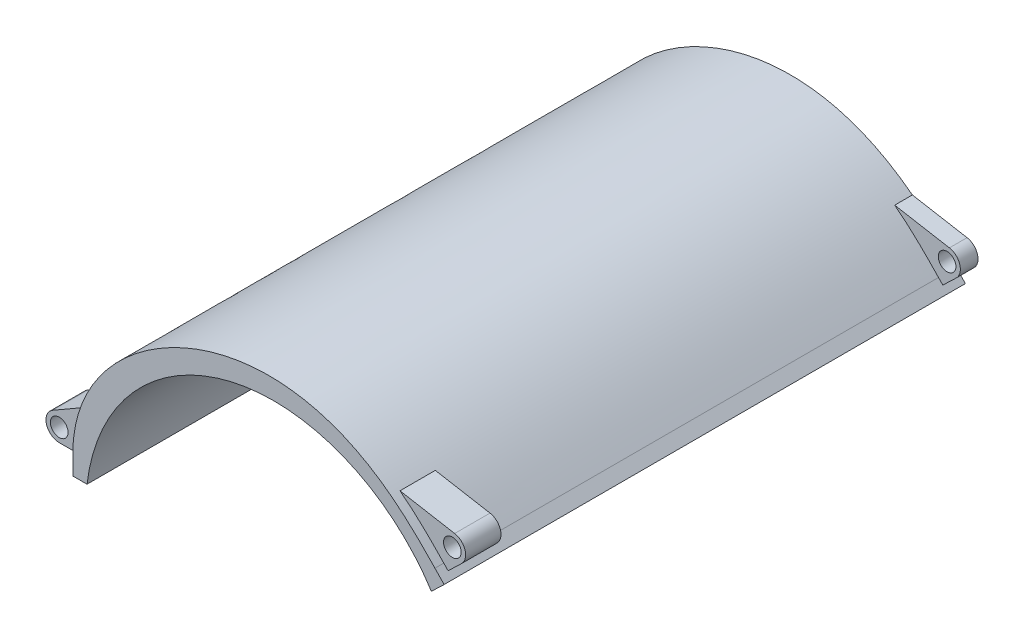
ISO-10303-21;
HEADER;
FILE_DESCRIPTION(('STEP AP214'),'2;1');
FILE_NAME('part.step','',(''),(''),'','','');
FILE_SCHEMA(('AUTOMOTIVE_DESIGN { 1 0 10303 214 1 1 1 1 }'));
ENDSEC;
DATA;
#1=APPLICATION_CONTEXT('core data for automotive mechanical design processes');
#2=APPLICATION_PROTOCOL_DEFINITION('international standard','automotive_design',2000,#1);
#3=PRODUCT_CONTEXT('',#1,'mechanical');
#4=PRODUCT('Part','Part','',(#3));
#5=PRODUCT_RELATED_PRODUCT_CATEGORY('part','',(#4));
#6=PRODUCT_DEFINITION_FORMATION('','',#4);
#7=PRODUCT_DEFINITION_CONTEXT('part definition',#1,'design');
#8=PRODUCT_DEFINITION('design','',#6,#7);
#9=PRODUCT_DEFINITION_SHAPE('','',#8);
#10=(LENGTH_UNIT() NAMED_UNIT(*) SI_UNIT(.MILLI.,.METRE.));
#11=(NAMED_UNIT(*) PLANE_ANGLE_UNIT() SI_UNIT($,.RADIAN.));
#12=(NAMED_UNIT(*) SI_UNIT($,.STERADIAN.) SOLID_ANGLE_UNIT());
#13=UNCERTAINTY_MEASURE_WITH_UNIT(LENGTH_MEASURE(1.E-05),#10,'distance_accuracy_value','');
#14=(GEOMETRIC_REPRESENTATION_CONTEXT(3) GLOBAL_UNCERTAINTY_ASSIGNED_CONTEXT((#13)) GLOBAL_UNIT_ASSIGNED_CONTEXT((#10,
#11,#12)) REPRESENTATION_CONTEXT('',''));
#15=CARTESIAN_POINT('',(0.,0.,0.));
#16=DIRECTION('',(0.,0.,1.));
#17=DIRECTION('',(1.,0.,0.));
#18=AXIS2_PLACEMENT_3D('',#15,#16,#17);
#19=CARTESIAN_POINT('',(-69.7200278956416,139.572690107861,295.));
#20=CARTESIAN_POINT('',(-108.187547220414,179.583185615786,295.));
#21=CARTESIAN_POINT('',(-152.416815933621,225.58654086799,295.));
#22=CARTESIAN_POINT('',(-219.133886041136,251.435560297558,295.));
#23=CARTESIAN_POINT('',(-287.408844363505,253.328836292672,295.));
#24=CARTESIAN_POINT('',(-359.356081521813,236.563554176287,295.));
#25=CARTESIAN_POINT('',(-477.15378099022,170.567422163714,295.));
#26=CARTESIAN_POINT('',(-479.524287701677,50.,295.));
#27=B_SPLINE_CURVE_WITH_KNOTS('',7,(#19,#20,#21,#22,#23,#24,#25,#26),.UNSPECIFIED.,.F.,.F.,(8,
8),(0.,1.),.UNSPECIFIED.);
#28=DIRECTION('',(0.,0.,-1.));
#29=VECTOR('',#28,1.);
#30=SURFACE_OF_LINEAR_EXTRUSION('',#27,#29);
#31=CARTESIAN_POINT('',(-119.307330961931,185.688881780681,-275.));
#32=CARTESIAN_POINT('',(-111.333957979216,179.561593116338,-275.));
#33=CARTESIAN_POINT('',(-103.683856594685,173.1559041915,-275.));
#34=CARTESIAN_POINT('',(-96.3532676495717,166.535005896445,-275.));
#35=CARTESIAN_POINT('',(-89.3294022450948,159.772367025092,-275.));
#36=CARTESIAN_POINT('',(-82.5854794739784,152.954189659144,-275.));
#37=CARTESIAN_POINT('',(-76.0741492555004,146.181682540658,-275.));
#38=CARTESIAN_POINT('',(-69.7200278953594,139.572690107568,-275.));
#39=B_SPLINE_CURVE_WITH_KNOTS('',7,(#31,#32,#33,#34,#35,#36,#37,#38),.UNSPECIFIED.,.F.,.F.,(8,
8),(0.,1.),.UNSPECIFIED.);
#40=CARTESIAN_POINT('',(-119.307330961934,185.688881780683,-275.));
#41=VERTEX_POINT('',#40);
#42=CARTESIAN_POINT('',(-69.7200278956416,139.572690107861,-275.));
#43=VERTEX_POINT('',#42);
#44=EDGE_CURVE('E58',#41,#43,#39,.T.);
#45=ORIENTED_EDGE('',*,*,#44,.F.);
#46=CARTESIAN_POINT('',(-119.307330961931,185.688881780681,-275.));
#47=DIRECTION('',(0.,0.,-1.));
#48=VECTOR('',#47,1.);
#49=LINE('',#46,#48);
#50=CARTESIAN_POINT('',(-119.307330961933,185.688881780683,-295.));
#51=VERTEX_POINT('',#50);
#52=EDGE_CURVE('E217',#41,#51,#49,.T.);
#53=ORIENTED_EDGE('',*,*,#52,.T.);
#54=CARTESIAN_POINT('',(-69.7200278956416,139.572690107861,-295.));
#55=CARTESIAN_POINT('',(-108.187547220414,179.583185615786,-295.));
#56=CARTESIAN_POINT('',(-152.416815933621,225.58654086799,-295.));
#57=CARTESIAN_POINT('',(-219.133886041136,251.435560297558,-295.));
#58=CARTESIAN_POINT('',(-287.408844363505,253.328836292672,-295.));
#59=CARTESIAN_POINT('',(-359.356081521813,236.563554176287,-295.));
#60=CARTESIAN_POINT('',(-477.15378099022,170.567422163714,-295.));
#61=CARTESIAN_POINT('',(-479.524287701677,50.,-295.));
#62=B_SPLINE_CURVE_WITH_KNOTS('',7,(#54,#55,#56,#57,#58,#59,#60,#61),.UNSPECIFIED.,.F.,.F.,(8,
8),(0.,1.),.UNSPECIFIED.);
#63=CARTESIAN_POINT('',(-472.826933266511,90.8956367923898,-295.));
#64=VERTEX_POINT('',#63);
#65=EDGE_CURVE('E370',#51,#64,#62,.T.);
#66=ORIENTED_EDGE('',*,*,#65,.T.);
#67=DIRECTION('',(0.,0.,-1.));
#68=VECTOR('',#67,1.);
#69=CARTESIAN_POINT('',(-472.826933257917,90.8956368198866,-275.));
#70=LINE('',#69,#68);
#71=CARTESIAN_POINT('',(-472.82693326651,90.8956367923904,-275.));
#72=VERTEX_POINT('',#71);
#73=EDGE_CURVE('E397',#72,#64,#70,.T.);
#74=ORIENTED_EDGE('',*,*,#73,.F.);
#75=CARTESIAN_POINT('',(-479.524287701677,50.0000000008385,-275.));
#76=CARTESIAN_POINT('',(-479.40077470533,56.2820507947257,-275.));
#77=CARTESIAN_POINT('',(-478.963896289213,62.4159497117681,-275.));
#78=CARTESIAN_POINT('',(-478.236465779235,68.4024521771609,-275.));
#79=CARTESIAN_POINT('',(-477.239796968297,74.2424995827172,-275.));
#80=CARTESIAN_POINT('',(-475.993797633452,79.9371958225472,-275.));
#81=CARTESIAN_POINT('',(-474.517057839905,85.4877859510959,-275.));
#82=CARTESIAN_POINT('',(-472.826933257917,90.8956368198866,-275.));
#83=B_SPLINE_CURVE_WITH_KNOTS('',7,(#75,#76,#77,#78,#79,#80,#81,#82),.UNSPECIFIED.,.F.,.F.,(8,
8),(0.,1.),.UNSPECIFIED.);
#84=CARTESIAN_POINT('',(-479.524287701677,50.,-275.));
#85=VERTEX_POINT('',#84);
#86=EDGE_CURVE('E411',#85,#72,#83,.T.);
#87=ORIENTED_EDGE('',*,*,#86,.F.);
#88=DIRECTION('',(0.,0.,-1.));
#89=VECTOR('',#88,1.);
#90=CARTESIAN_POINT('',(-479.524287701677,50.,295.));
#91=LINE('',#90,#89);
#92=CARTESIAN_POINT('',(-479.524287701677,50.0000000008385,245.));
#93=VERTEX_POINT('',#92);
#94=EDGE_CURVE('E393',#93,#85,#91,.T.);
#95=ORIENTED_EDGE('',*,*,#94,.F.);
#96=CARTESIAN_POINT('',(-479.524287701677,50.0000000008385,245.));
#97=CARTESIAN_POINT('',(-479.40077470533,56.2820507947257,245.));
#98=CARTESIAN_POINT('',(-478.963896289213,62.4159497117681,245.));
#99=CARTESIAN_POINT('',(-478.236465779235,68.4024521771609,245.));
#100=CARTESIAN_POINT('',(-477.239796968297,74.2424995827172,245.));
#101=CARTESIAN_POINT('',(-475.993797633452,79.9371958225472,245.));
#102=CARTESIAN_POINT('',(-474.517057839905,85.4877859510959,245.));
#103=CARTESIAN_POINT('',(-472.826933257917,90.8956368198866,245.));
#104=B_SPLINE_CURVE_WITH_KNOTS('',7,(#96,#97,#98,#99,#100,#101,#102,#103),.UNSPECIFIED.,.F.,.F.,
(8,8),(0.94789595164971,1.),.UNSPECIFIED.);
#105=CARTESIAN_POINT('',(-472.826933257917,90.8956368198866,245.));
#106=VERTEX_POINT('',#105);
#107=EDGE_CURVE('E513',#93,#106,#104,.T.);
#108=ORIENTED_EDGE('',*,*,#107,.T.);
#109=DIRECTION('',(0.,0.,1.));
#110=VECTOR('',#109,1.);
#111=CARTESIAN_POINT('',(-472.826933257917,90.8956368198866,245.));
#112=LINE('',#111,#110);
#113=CARTESIAN_POINT('',(-472.826933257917,90.8956368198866,285.));
#114=VERTEX_POINT('',#113);
#115=EDGE_CURVE('E541',#106,#114,#112,.T.);
#116=ORIENTED_EDGE('',*,*,#115,.T.);
#117=CARTESIAN_POINT('',(-479.524287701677,50.0000000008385,285.));
#118=CARTESIAN_POINT('',(-479.40077470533,56.2820507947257,285.));
#119=CARTESIAN_POINT('',(-478.963896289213,62.4159497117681,285.));
#120=CARTESIAN_POINT('',(-478.236465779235,68.4024521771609,285.));
#121=CARTESIAN_POINT('',(-477.239796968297,74.2424995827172,285.));
#122=CARTESIAN_POINT('',(-475.993797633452,79.9371958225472,285.));
#123=CARTESIAN_POINT('',(-474.517057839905,85.4877859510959,285.));
#124=CARTESIAN_POINT('',(-472.826933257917,90.8956368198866,285.));
#125=B_SPLINE_CURVE_WITH_KNOTS('',7,(#117,#118,#119,#120,#121,#122,#123,#124),.UNSPECIFIED.,.F.,
.F.,(8,8),(0.94789595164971,1.),.UNSPECIFIED.);
#126=CARTESIAN_POINT('',(-479.524287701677,50.0000000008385,285.));
#127=VERTEX_POINT('',#126);
#128=EDGE_CURVE('E531',#127,#114,#125,.T.);
#129=ORIENTED_EDGE('',*,*,#128,.F.);
#130=CARTESIAN_POINT('',(-479.524287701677,50.,295.));
#131=VERTEX_POINT('',#130);
#132=EDGE_CURVE('E387',#131,#127,#91,.T.);
#133=ORIENTED_EDGE('',*,*,#132,.F.);
#134=CARTESIAN_POINT('',(-69.7200278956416,139.572690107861,295.));
#135=VERTEX_POINT('',#134);
#136=EDGE_CURVE('E348',#135,#131,#27,.T.);
#137=ORIENTED_EDGE('',*,*,#136,.F.);
#138=DIRECTION('',(0.,0.,-1.));
#139=VECTOR('',#138,1.);
#140=CARTESIAN_POINT('',(-69.7200278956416,139.572690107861,295.));
#141=LINE('',#140,#139);
#142=CARTESIAN_POINT('',(-69.7200278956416,139.572690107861,285.));
#143=VERTEX_POINT('',#142);
#144=EDGE_CURVE('E11',#135,#143,#141,.T.);
#145=ORIENTED_EDGE('',*,*,#144,.T.);
#146=CARTESIAN_POINT('',(-119.307330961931,185.688881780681,285.));
#147=CARTESIAN_POINT('',(-111.333957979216,179.561593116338,285.));
#148=CARTESIAN_POINT('',(-103.683856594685,173.1559041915,285.));
#149=CARTESIAN_POINT('',(-96.3532676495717,166.535005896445,285.));
#150=CARTESIAN_POINT('',(-89.3294022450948,159.772367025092,285.));
#151=CARTESIAN_POINT('',(-82.5854794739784,152.954189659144,285.));
#152=CARTESIAN_POINT('',(-76.0741492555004,146.181682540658,285.));
#153=CARTESIAN_POINT('',(-69.7200278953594,139.572690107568,285.));
#154=B_SPLINE_CURVE_WITH_KNOTS('',7,(#146,#147,#148,#149,#150,#151,#152,#153),.UNSPECIFIED.,.F.,
.F.,(8,8),(0.,0.165181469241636),.UNSPECIFIED.);
#155=CARTESIAN_POINT('',(-119.307330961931,185.688881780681,285.));
#156=VERTEX_POINT('',#155);
#157=EDGE_CURVE('E466',#156,#143,#154,.T.);
#158=ORIENTED_EDGE('',*,*,#157,.F.);
#159=DIRECTION('',(0.,0.,1.));
#160=VECTOR('',#159,1.);
#161=CARTESIAN_POINT('',(-119.307330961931,185.688881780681,245.));
#162=LINE('',#161,#160);
#163=CARTESIAN_POINT('',(-119.307330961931,185.688881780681,245.));
#164=VERTEX_POINT('',#163);
#165=EDGE_CURVE('E400',#164,#156,#162,.T.);
#166=ORIENTED_EDGE('',*,*,#165,.F.);
#167=CARTESIAN_POINT('',(-119.307330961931,185.688881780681,245.));
#168=CARTESIAN_POINT('',(-111.333957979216,179.561593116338,245.));
#169=CARTESIAN_POINT('',(-103.683856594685,173.1559041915,245.));
#170=CARTESIAN_POINT('',(-96.3532676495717,166.535005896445,245.));
#171=CARTESIAN_POINT('',(-89.3294022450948,159.772367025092,245.));
#172=CARTESIAN_POINT('',(-82.5854794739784,152.954189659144,245.));
#173=CARTESIAN_POINT('',(-76.0741492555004,146.181682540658,245.));
#174=CARTESIAN_POINT('',(-69.7200278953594,139.572690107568,245.));
#175=B_SPLINE_CURVE_WITH_KNOTS('',7,(#167,#168,#169,#170,#171,#172,#173,#174),.UNSPECIFIED.,.F.,
.F.,(8,8),(0.,0.165181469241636),.UNSPECIFIED.);
#176=CARTESIAN_POINT('',(-69.7200278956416,139.572690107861,245.));
#177=VERTEX_POINT('',#176);
#178=EDGE_CURVE('E457',#164,#177,#175,.T.);
#179=ORIENTED_EDGE('',*,*,#178,.T.);
#180=EDGE_CURVE('E50',#177,#43,#141,.T.);
#181=ORIENTED_EDGE('',*,*,#180,.T.);
#182=EDGE_LOOP('',(#45,#53,#66,#74,#87,#95,#108,#116,#129,#133,#137,#145,#158,#166,#179,#181));
#183=FACE_BOUND('',#182,.T.);
#184=ADVANCED_FACE('F41',(#183),#30,.F.);
#185=CARTESIAN_POINT('',(-479.524287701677,25.,295.));
#186=DIRECTION('',(1.,0.,0.));
#187=DIRECTION('',(0.,1.,0.));
#188=AXIS2_PLACEMENT_3D('',#185,#186,#187);
#189=PLANE('',#188);
#190=DIRECTION('',(0.,-1.,0.));
#191=VECTOR('',#190,1.);
#192=CARTESIAN_POINT('',(-479.524287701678,234.472912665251,-275.));
#193=LINE('',#192,#191);
#194=CARTESIAN_POINT('',(-479.524287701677,40.,-275.));
#195=VERTEX_POINT('',#194);
#196=EDGE_CURVE('E419',#85,#195,#193,.T.);
#197=ORIENTED_EDGE('',*,*,#196,.T.);
#198=DIRECTION('',(0.,0.,-1.));
#199=VECTOR('',#198,1.);
#200=CARTESIAN_POINT('',(-479.524287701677,40.,-275.));
#201=LINE('',#200,#199);
#202=CARTESIAN_POINT('',(-479.524287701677,40.,-295.));
#203=VERTEX_POINT('',#202);
#204=EDGE_CURVE('E423',#195,#203,#201,.T.);
#205=ORIENTED_EDGE('',*,*,#204,.T.);
#206=DIRECTION('',(0.,-1.,0.));
#207=VECTOR('',#206,1.);
#208=CARTESIAN_POINT('',(-479.524287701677,25.,-295.));
#209=LINE('',#208,#207);
#210=CARTESIAN_POINT('',(-479.524287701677,25.,-295.));
#211=VERTEX_POINT('',#210);
#212=EDGE_CURVE('E376',#203,#211,#209,.T.);
#213=ORIENTED_EDGE('',*,*,#212,.T.);
#214=DIRECTION('',(0.,0.,-1.));
#215=VECTOR('',#214,1.);
#216=CARTESIAN_POINT('',(-479.524287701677,25.,295.));
#217=LINE('',#216,#215);
#218=CARTESIAN_POINT('',(-479.524287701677,25.,295.));
#219=VERTEX_POINT('',#218);
#220=EDGE_CURVE('E396',#219,#211,#217,.T.);
#221=ORIENTED_EDGE('',*,*,#220,.F.);
#222=DIRECTION('',(0.,-1.,0.));
#223=VECTOR('',#222,1.);
#224=CARTESIAN_POINT('',(-479.524287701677,25.,295.));
#225=LINE('',#224,#223);
#226=EDGE_CURVE('E354',#131,#219,#225,.T.);
#227=ORIENTED_EDGE('',*,*,#226,.F.);
#228=ORIENTED_EDGE('',*,*,#132,.T.);
#229=DIRECTION('',(0.,1.,0.));
#230=VECTOR('',#229,1.);
#231=CARTESIAN_POINT('',(-479.524287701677,50.0000000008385,285.));
#232=LINE('',#231,#230);
#233=CARTESIAN_POINT('',(-479.524287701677,40.,285.));
#234=VERTEX_POINT('',#233);
#235=EDGE_CURVE('E529',#234,#127,#232,.T.);
#236=ORIENTED_EDGE('',*,*,#235,.F.);
#237=DIRECTION('',(0.,0.,1.));
#238=VECTOR('',#237,1.);
#239=CARTESIAN_POINT('',(-479.524287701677,40.,245.));
#240=LINE('',#239,#238);
#241=CARTESIAN_POINT('',(-479.524287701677,40.,245.));
#242=VERTEX_POINT('',#241);
#243=EDGE_CURVE('E544',#242,#234,#240,.T.);
#244=ORIENTED_EDGE('',*,*,#243,.F.);
#245=DIRECTION('',(0.,1.,0.));
#246=VECTOR('',#245,1.);
#247=CARTESIAN_POINT('',(-479.524287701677,50.0000000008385,245.));
#248=LINE('',#247,#246);
#249=EDGE_CURVE('E510',#242,#93,#248,.T.);
#250=ORIENTED_EDGE('',*,*,#249,.T.);
#251=ORIENTED_EDGE('',*,*,#94,.T.);
#252=EDGE_LOOP('',(#197,#205,#213,#221,#227,#228,#236,#244,#250,#251));
#253=FACE_BOUND('',#252,.T.);
#254=ADVANCED_FACE('F341',(#253),#189,.F.);
#255=CARTESIAN_POINT('',(-59.3239744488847,128.759639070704,295.));
#256=DIRECTION('',(-0.720870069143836,-0.693070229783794,0.));
#257=DIRECTION('',(0.693070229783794,-0.720870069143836,0.));
#258=AXIS2_PLACEMENT_3D('',#255,#256,#257);
#259=PLANE('',#258);
#260=DIRECTION('',(-0.693070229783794,0.720870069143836,0.));
#261=VECTOR('',#260,1.);
#262=CARTESIAN_POINT('',(-59.3239744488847,128.759639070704,-295.));
#263=LINE('',#262,#261);
#264=CARTESIAN_POINT('',(-59.3239744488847,128.759639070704,-295.));
#265=VERTEX_POINT('',#264);
#266=CARTESIAN_POINT('',(-64.8607561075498,134.51850737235,-295.));
#267=VERTEX_POINT('',#266);
#268=EDGE_CURVE('E368',#265,#267,#263,.T.);
#269=ORIENTED_EDGE('',*,*,#268,.T.);
#270=DIRECTION('',(0.,0.,-1.));
#271=VECTOR('',#270,1.);
#272=CARTESIAN_POINT('',(-64.8607561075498,134.51850737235,-275.));
#273=LINE('',#272,#271);
#274=CARTESIAN_POINT('',(-64.8607561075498,134.51850737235,-275.));
#275=VERTEX_POINT('',#274);
#276=EDGE_CURVE('E66',#275,#267,#273,.T.);
#277=ORIENTED_EDGE('',*,*,#276,.F.);
#278=DIRECTION('',(-0.693070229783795,0.720870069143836,0.));
#279=VECTOR('',#278,1.);
#280=CARTESIAN_POINT('',(-207.944056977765,283.341043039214,-275.));
#281=LINE('',#280,#279);
#282=EDGE_CURVE('E229',#275,#43,#281,.T.);
#283=ORIENTED_EDGE('',*,*,#282,.T.);
#284=ORIENTED_EDGE('',*,*,#180,.F.);
#285=DIRECTION('',(0.693070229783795,-0.720870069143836,0.));
#286=VECTOR('',#285,1.);
#287=CARTESIAN_POINT('',(-64.8607561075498,134.51850737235,245.));
#288=LINE('',#287,#286);
#289=CARTESIAN_POINT('',(-64.8607561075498,134.51850737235,245.));
#290=VERTEX_POINT('',#289);
#291=EDGE_CURVE('E483',#177,#290,#288,.T.);
#292=ORIENTED_EDGE('',*,*,#291,.T.);
#293=DIRECTION('',(0.,0.,1.));
#294=VECTOR('',#293,1.);
#295=CARTESIAN_POINT('',(-64.8607561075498,134.51850737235,245.));
#296=LINE('',#295,#294);
#297=CARTESIAN_POINT('',(-64.8607561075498,134.51850737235,285.));
#298=VERTEX_POINT('',#297);
#299=EDGE_CURVE('E444',#290,#298,#296,.T.);
#300=ORIENTED_EDGE('',*,*,#299,.T.);
#301=DIRECTION('',(0.693070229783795,-0.720870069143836,0.));
#302=VECTOR('',#301,1.);
#303=CARTESIAN_POINT('',(-64.8607561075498,134.51850737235,285.));
#304=LINE('',#303,#302);
#305=EDGE_CURVE('E463',#143,#298,#304,.T.);
#306=ORIENTED_EDGE('',*,*,#305,.F.);
#307=ORIENTED_EDGE('',*,*,#144,.F.);
#308=DIRECTION('',(-0.693070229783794,0.720870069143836,0.));
#309=VECTOR('',#308,1.);
#310=CARTESIAN_POINT('',(-59.3239744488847,128.759639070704,295.));
#311=LINE('',#310,#309);
#312=CARTESIAN_POINT('',(-59.3239744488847,128.759639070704,295.));
#313=VERTEX_POINT('',#312);
#314=EDGE_CURVE('E355',#313,#135,#311,.T.);
#315=ORIENTED_EDGE('',*,*,#314,.F.);
#316=DIRECTION('',(0.,0.,-1.));
#317=VECTOR('',#316,1.);
#318=CARTESIAN_POINT('',(-59.3239744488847,128.759639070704,295.));
#319=LINE('',#318,#317);
#320=EDGE_CURVE('E367',#313,#265,#319,.T.);
#321=ORIENTED_EDGE('',*,*,#320,.T.);
#322=EDGE_LOOP('',(#269,#277,#283,#284,#292,#300,#306,#307,#315,#321));
#323=FACE_BOUND('',#322,.T.);
#324=ADVANCED_FACE('F43',(#323),#259,.F.);
#325=CARTESIAN_POINT('',(-463.524287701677,25.,295.));
#326=DIRECTION('',(0.,1.,0.));
#327=DIRECTION('',(0.,0.,1.));
#328=AXIS2_PLACEMENT_3D('',#325,#326,#327);
#329=PLANE('',#328);
#330=DIRECTION('',(1.,0.,0.));
#331=VECTOR('',#330,1.);
#332=CARTESIAN_POINT('',(-463.524287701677,25.,-295.));
#333=LINE('',#332,#331);
#334=CARTESIAN_POINT('',(-463.524287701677,25.0000000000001,-295.));
#335=VERTEX_POINT('',#334);
#336=EDGE_CURVE('E615',#211,#335,#333,.T.);
#337=ORIENTED_EDGE('',*,*,#336,.T.);
#338=DIRECTION('',(0.,0.,-1.));
#339=VECTOR('',#338,1.);
#340=CARTESIAN_POINT('',(-463.524287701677,25.0000000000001,295.));
#341=LINE('',#340,#339);
#342=CARTESIAN_POINT('',(-463.524287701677,25.0000000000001,295.));
#343=VERTEX_POINT('',#342);
#344=EDGE_CURVE('E627',#343,#335,#341,.T.);
#345=ORIENTED_EDGE('',*,*,#344,.F.);
#346=DIRECTION('',(1.,0.,0.));
#347=VECTOR('',#346,1.);
#348=CARTESIAN_POINT('',(-463.524287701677,25.,295.));
#349=LINE('',#348,#347);
#350=EDGE_CURVE('E361',#219,#343,#349,.T.);
#351=ORIENTED_EDGE('',*,*,#350,.F.);
#352=ORIENTED_EDGE('',*,*,#220,.T.);
#353=EDGE_LOOP('',(#337,#345,#351,#352));
#354=FACE_BOUND('',#353,.T.);
#355=ADVANCED_FACE('F336',(#354),#329,.F.);
#356=CARTESIAN_POINT('',(-252.5,1.52655665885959E-13,295.));
#357=DIRECTION('',(0.,0.,-1.));
#358=DIRECTION('',(-1.,0.,0.));
#359=AXIS2_PLACEMENT_3D('',#356,#357,#358);
#360=CYLINDRICAL_SURFACE('',#359,212.5);
#361=CARTESIAN_POINT('',(-252.5,1.52655665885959E-13,-295.));
#362=DIRECTION('',(0.,0.,-1.));
#363=DIRECTION('',(1.,0.,0.));
#364=AXIS2_PLACEMENT_3D('',#361,#362,#363);
#365=CIRCLE('',#364,212.5);
#366=CARTESIAN_POINT('',(-73.7413758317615,114.898234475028,-295.));
#367=VERTEX_POINT('',#366);
#368=EDGE_CURVE('E617',#335,#367,#365,.T.);
#369=ORIENTED_EDGE('',*,*,#368,.T.);
#370=DIRECTION('',(0.,0.,-1.));
#371=VECTOR('',#370,1.);
#372=CARTESIAN_POINT('',(-73.7413758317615,114.898234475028,295.));
#373=LINE('',#372,#371);
#374=CARTESIAN_POINT('',(-73.7413758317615,114.898234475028,295.));
#375=VERTEX_POINT('',#374);
#376=EDGE_CURVE('E624',#375,#367,#373,.T.);
#377=ORIENTED_EDGE('',*,*,#376,.F.);
#378=CARTESIAN_POINT('',(-252.5,1.52655665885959E-13,295.));
#379=DIRECTION('',(0.,0.,-1.));
#380=DIRECTION('',(1.,0.,0.));
#381=AXIS2_PLACEMENT_3D('',#378,#379,#380);
#382=CIRCLE('',#381,212.5);
#383=EDGE_CURVE('E363',#343,#375,#382,.T.);
#384=ORIENTED_EDGE('',*,*,#383,.F.);
#385=ORIENTED_EDGE('',*,*,#344,.T.);
#386=EDGE_LOOP('',(#369,#377,#384,#385));
#387=FACE_BOUND('',#386,.T.);
#388=ADVANCED_FACE('F332',(#387),#360,.F.);
#389=CARTESIAN_POINT('',(-59.3239744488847,128.759639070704,295.));
#390=DIRECTION('',(-0.693070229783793,0.720870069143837,0.));
#391=DIRECTION('',(-0.720870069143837,-0.693070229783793,0.));
#392=AXIS2_PLACEMENT_3D('',#389,#390,#391);
#393=PLANE('',#392);
#394=DIRECTION('',(0.720870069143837,0.693070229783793,0.));
#395=VECTOR('',#394,1.);
#396=CARTESIAN_POINT('',(-59.3239744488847,128.759639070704,-295.));
#397=LINE('',#396,#395);
#398=EDGE_CURVE('E568',#367,#265,#397,.T.);
#399=ORIENTED_EDGE('',*,*,#398,.T.);
#400=ORIENTED_EDGE('',*,*,#320,.F.);
#401=DIRECTION('',(0.720870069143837,0.693070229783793,0.));
#402=VECTOR('',#401,1.);
#403=CARTESIAN_POINT('',(-59.3239744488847,128.759639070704,295.));
#404=LINE('',#403,#402);
#405=EDGE_CURVE('E365',#375,#313,#404,.T.);
#406=ORIENTED_EDGE('',*,*,#405,.F.);
#407=ORIENTED_EDGE('',*,*,#376,.T.);
#408=EDGE_LOOP('',(#399,#400,#406,#407));
#409=FACE_BOUND('',#408,.T.);
#410=ADVANCED_FACE('F325',(#409),#393,.F.);
#411=CARTESIAN_POINT('',(-258.772343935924,234.472912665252,295.));
#412=DIRECTION('',(0.,0.,-1.));
#413=DIRECTION('',(-1.,0.,0.));
#414=AXIS2_PLACEMENT_3D('',#411,#412,#413);
#415=PLANE('',#414);
#416=ORIENTED_EDGE('',*,*,#314,.T.);
#417=ORIENTED_EDGE('',*,*,#136,.T.);
#418=ORIENTED_EDGE('',*,*,#226,.T.);
#419=ORIENTED_EDGE('',*,*,#350,.T.);
#420=ORIENTED_EDGE('',*,*,#383,.T.);
#421=ORIENTED_EDGE('',*,*,#405,.T.);
#422=EDGE_LOOP('',(#416,#417,#418,#419,#420,#421));
#423=FACE_BOUND('',#422,.T.);
#424=ADVANCED_FACE('F322',(#423),#415,.F.);
#425=CARTESIAN_POINT('',(-258.772343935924,234.472912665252,-295.));
#426=DIRECTION('',(0.,0.,-1.));
#427=DIRECTION('',(-1.,0.,0.));
#428=AXIS2_PLACEMENT_3D('',#425,#426,#427);
#429=PLANE('',#428);
#430=ORIENTED_EDGE('',*,*,#65,.F.);
#431=DIRECTION('',(0.984807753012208,-0.173648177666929,0.));
#432=VECTOR('',#431,1.);
#433=CARTESIAN_POINT('',(-262.909519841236,211.009822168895,-295.));
#434=LINE('',#433,#432);
#435=CARTESIAN_POINT('',(-57.3952773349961,174.772116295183,-295.));
#436=VERTEX_POINT('',#435);
#437=EDGE_CURVE('E241',#51,#436,#434,.T.);
#438=ORIENTED_EDGE('',*,*,#437,.T.);
#439=CARTESIAN_POINT('',(-60.0000000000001,160.,-295.));
#440=DIRECTION('',(0.,0.,-1.));
#441=DIRECTION('',(-1.,0.,0.));
#442=AXIS2_PLACEMENT_3D('',#439,#440,#441);
#443=CIRCLE('',#442,15.);
#444=CARTESIAN_POINT('',(-49.6039465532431,149.186948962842,-295.));
#445=VERTEX_POINT('',#444);
#446=EDGE_CURVE('E211',#436,#445,#443,.T.);
#447=ORIENTED_EDGE('',*,*,#446,.T.);
#448=DIRECTION('',(-0.720870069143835,-0.693070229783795,0.));
#449=VECTOR('',#448,1.);
#450=CARTESIAN_POINT('',(-115.689043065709,85.6503769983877,-295.));
#451=LINE('',#450,#449);
#452=EDGE_CURVE('E580',#445,#267,#451,.T.);
#453=ORIENTED_EDGE('',*,*,#452,.T.);
#454=ORIENTED_EDGE('',*,*,#268,.F.);
#455=ORIENTED_EDGE('',*,*,#398,.F.);
#456=ORIENTED_EDGE('',*,*,#368,.F.);
#457=ORIENTED_EDGE('',*,*,#336,.F.);
#458=ORIENTED_EDGE('',*,*,#212,.F.);
#459=DIRECTION('',(-1.,0.,0.));
#460=VECTOR('',#459,1.);
#461=CARTESIAN_POINT('',(-258.772343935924,40.,-295.));
#462=LINE('',#461,#460);
#463=CARTESIAN_POINT('',(-505.,40.,-295.));
#464=VERTEX_POINT('',#463);
#465=EDGE_CURVE('E415',#203,#464,#462,.T.);
#466=ORIENTED_EDGE('',*,*,#465,.T.);
#467=CARTESIAN_POINT('',(-505.,55.,-295.));
#468=DIRECTION('',(0.,0.,-1.));
#469=DIRECTION('',(-1.,0.,0.));
#470=AXIS2_PLACEMENT_3D('',#467,#468,#469);
#471=CIRCLE('',#470,15.);
#472=CARTESIAN_POINT('',(-512.5,67.9903810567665,-295.));
#473=VERTEX_POINT('',#472);
#474=EDGE_CURVE('E407',#464,#473,#471,.T.);
#475=ORIENTED_EDGE('',*,*,#474,.T.);
#476=DIRECTION('',(0.866025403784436,0.500000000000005,0.));
#477=VECTOR('',#476,1.);
#478=CARTESIAN_POINT('',(-250.115207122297,219.478311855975,-295.));
#479=LINE('',#478,#477);
#480=EDGE_CURVE('E404',#473,#64,#479,.T.);
#481=ORIENTED_EDGE('',*,*,#480,.T.);
#482=EDGE_LOOP('',(#430,#438,#447,#453,#454,#455,#456,#457,#458,#466,#475,#481));
#483=FACE_BOUND('',#482,.T.);
#484=CARTESIAN_POINT('',(-505.,55.,-295.));
#485=DIRECTION('',(0.,0.,-1.));
#486=DIRECTION('',(-1.,0.,0.));
#487=AXIS2_PLACEMENT_3D('',#484,#485,#486);
#488=CIRCLE('',#487,9.99999999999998);
#489=CARTESIAN_POINT('',(-515.,55.,-295.));
#490=VERTEX_POINT('',#489);
#491=EDGE_CURVE('E599',#490,#490,#488,.T.);
#492=ORIENTED_EDGE('',*,*,#491,.F.);
#493=EDGE_LOOP('',(#492));
#494=FACE_BOUND('',#493,.T.);
#495=CARTESIAN_POINT('',(-60.0000000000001,160.,-295.));
#496=DIRECTION('',(0.,0.,-1.));
#497=DIRECTION('',(-1.,0.,0.));
#498=AXIS2_PLACEMENT_3D('',#495,#496,#497);
#499=CIRCLE('',#498,9.99999999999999);
#500=CARTESIAN_POINT('',(-70.,160.,-295.));
#501=VERTEX_POINT('',#500);
#502=EDGE_CURVE('E634',#501,#501,#499,.T.);
#503=ORIENTED_EDGE('',*,*,#502,.F.);
#504=EDGE_LOOP('',(#503));
#505=FACE_BOUND('',#504,.T.);
#506=ADVANCED_FACE('F320',(#483,#494,#505),#429,.T.);
#507=CARTESIAN_POINT('',(-505.,55.,245.));
#508=DIRECTION('',(0.,0.,1.));
#509=DIRECTION('',(1.,0.,0.));
#510=AXIS2_PLACEMENT_3D('',#507,#508,#509);
#511=CYLINDRICAL_SURFACE('',#510,15.);
#512=CARTESIAN_POINT('',(-505.,55.,285.));
#513=DIRECTION('',(0.,0.,1.));
#514=DIRECTION('',(1.,0.,0.));
#515=AXIS2_PLACEMENT_3D('',#512,#513,#514);
#516=CIRCLE('',#515,15.);
#517=CARTESIAN_POINT('',(-512.5,67.9903810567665,285.));
#518=VERTEX_POINT('',#517);
#519=CARTESIAN_POINT('',(-505.,40.,285.));
#520=VERTEX_POINT('',#519);
#521=EDGE_CURVE('E500',#518,#520,#516,.T.);
#522=ORIENTED_EDGE('',*,*,#521,.F.);
#523=DIRECTION('',(0.,0.,1.));
#524=VECTOR('',#523,1.);
#525=CARTESIAN_POINT('',(-512.5,67.9903810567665,245.));
#526=LINE('',#525,#524);
#527=CARTESIAN_POINT('',(-512.5,67.9903810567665,245.));
#528=VERTEX_POINT('',#527);
#529=EDGE_CURVE('E371',#528,#518,#526,.T.);
#530=ORIENTED_EDGE('',*,*,#529,.F.);
#531=CARTESIAN_POINT('',(-505.,55.,245.));
#532=DIRECTION('',(0.,0.,1.));
#533=DIRECTION('',(1.,0.,0.));
#534=AXIS2_PLACEMENT_3D('',#531,#532,#533);
#535=CIRCLE('',#534,15.);
#536=CARTESIAN_POINT('',(-505.,40.,245.));
#537=VERTEX_POINT('',#536);
#538=EDGE_CURVE('E503',#528,#537,#535,.T.);
#539=ORIENTED_EDGE('',*,*,#538,.T.);
#540=DIRECTION('',(0.,0.,1.));
#541=VECTOR('',#540,1.);
#542=CARTESIAN_POINT('',(-505.,40.,245.));
#543=LINE('',#542,#541);
#544=EDGE_CURVE('E524',#537,#520,#543,.T.);
#545=ORIENTED_EDGE('',*,*,#544,.T.);
#546=EDGE_LOOP('',(#522,#530,#539,#545));
#547=FACE_BOUND('',#546,.T.);
#548=ADVANCED_FACE('F313',(#547),#511,.T.);
#549=CARTESIAN_POINT('',(-512.5,67.9903810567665,245.));
#550=DIRECTION('',(-0.500000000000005,0.866025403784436,0.));
#551=DIRECTION('',(-0.866025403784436,-0.500000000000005,0.));
#552=AXIS2_PLACEMENT_3D('',#549,#550,#551);
#553=PLANE('',#552);
#554=DIRECTION('',(-0.866025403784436,-0.500000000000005,0.));
#555=VECTOR('',#554,1.);
#556=CARTESIAN_POINT('',(-512.5,67.9903810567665,285.));
#557=LINE('',#556,#555);
#558=EDGE_CURVE('E507',#114,#518,#557,.T.);
#559=ORIENTED_EDGE('',*,*,#558,.F.);
#560=ORIENTED_EDGE('',*,*,#115,.F.);
#561=DIRECTION('',(-0.866025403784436,-0.500000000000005,0.));
#562=VECTOR('',#561,1.);
#563=CARTESIAN_POINT('',(-512.5,67.9903810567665,245.));
#564=LINE('',#563,#562);
#565=EDGE_CURVE('E518',#106,#528,#564,.T.);
#566=ORIENTED_EDGE('',*,*,#565,.T.);
#567=ORIENTED_EDGE('',*,*,#529,.T.);
#568=EDGE_LOOP('',(#559,#560,#566,#567));
#569=FACE_BOUND('',#568,.T.);
#570=ADVANCED_FACE('F310',(#569),#553,.T.);
#571=CARTESIAN_POINT('',(-505.,40.,245.));
#572=DIRECTION('',(0.,-1.,0.));
#573=DIRECTION('',(0.,0.,-1.));
#574=AXIS2_PLACEMENT_3D('',#571,#572,#573);
#575=PLANE('',#574);
#576=DIRECTION('',(1.,0.,0.));
#577=VECTOR('',#576,1.);
#578=CARTESIAN_POINT('',(-505.,40.,285.));
#579=LINE('',#578,#577);
#580=EDGE_CURVE('E527',#520,#234,#579,.T.);
#581=ORIENTED_EDGE('',*,*,#580,.F.);
#582=ORIENTED_EDGE('',*,*,#544,.F.);
#583=DIRECTION('',(1.,0.,0.));
#584=VECTOR('',#583,1.);
#585=CARTESIAN_POINT('',(-505.,40.,245.));
#586=LINE('',#585,#584);
#587=EDGE_CURVE('E506',#537,#242,#586,.T.);
#588=ORIENTED_EDGE('',*,*,#587,.T.);
#589=ORIENTED_EDGE('',*,*,#243,.T.);
#590=EDGE_LOOP('',(#581,#582,#588,#589));
#591=FACE_BOUND('',#590,.T.);
#592=ADVANCED_FACE('F305',(#591),#575,.T.);
#593=CARTESIAN_POINT('',(-505.,55.,245.));
#594=DIRECTION('',(0.,0.,1.));
#595=DIRECTION('',(1.,0.,0.));
#596=AXIS2_PLACEMENT_3D('',#593,#594,#595);
#597=PLANE('',#596);
#598=CARTESIAN_POINT('',(-505.,55.,245.));
#599=DIRECTION('',(0.,0.,1.));
#600=DIRECTION('',(1.,0.,0.));
#601=AXIS2_PLACEMENT_3D('',#598,#599,#600);
#602=CIRCLE('',#601,9.99999999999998);
#603=CARTESIAN_POINT('',(-495.,55.,245.));
#604=VERTEX_POINT('',#603);
#605=EDGE_CURVE('E497',#604,#604,#602,.T.);
#606=ORIENTED_EDGE('',*,*,#605,.T.);
#607=EDGE_LOOP('',(#606));
#608=FACE_BOUND('',#607,.T.);
#609=ORIENTED_EDGE('',*,*,#538,.F.);
#610=ORIENTED_EDGE('',*,*,#565,.F.);
#611=ORIENTED_EDGE('',*,*,#107,.F.);
#612=ORIENTED_EDGE('',*,*,#249,.F.);
#613=ORIENTED_EDGE('',*,*,#587,.F.);
#614=EDGE_LOOP('',(#609,#610,#611,#612,#613));
#615=FACE_BOUND('',#614,.T.);
#616=ADVANCED_FACE('F302',(#608,#615),#597,.F.);
#617=CARTESIAN_POINT('',(-505.,55.,285.));
#618=DIRECTION('',(0.,0.,1.));
#619=DIRECTION('',(1.,0.,0.));
#620=AXIS2_PLACEMENT_3D('',#617,#618,#619);
#621=PLANE('',#620);
#622=CARTESIAN_POINT('',(-505.,55.,285.));
#623=DIRECTION('',(0.,0.,1.));
#624=DIRECTION('',(1.,0.,0.));
#625=AXIS2_PLACEMENT_3D('',#622,#623,#624);
#626=CIRCLE('',#625,9.99999999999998);
#627=CARTESIAN_POINT('',(-495.,55.,285.));
#628=VERTEX_POINT('',#627);
#629=EDGE_CURVE('E494',#628,#628,#626,.T.);
#630=ORIENTED_EDGE('',*,*,#629,.F.);
#631=EDGE_LOOP('',(#630));
#632=FACE_BOUND('',#631,.T.);
#633=ORIENTED_EDGE('',*,*,#521,.T.);
#634=ORIENTED_EDGE('',*,*,#580,.T.);
#635=ORIENTED_EDGE('',*,*,#235,.T.);
#636=ORIENTED_EDGE('',*,*,#128,.T.);
#637=ORIENTED_EDGE('',*,*,#558,.T.);
#638=EDGE_LOOP('',(#633,#634,#635,#636,#637));
#639=FACE_BOUND('',#638,.T.);
#640=ADVANCED_FACE('F300',(#632,#639),#621,.T.);
#641=CARTESIAN_POINT('',(-505.,55.,245.));
#642=DIRECTION('',(0.,0.,1.));
#643=DIRECTION('',(1.,0.,0.));
#644=AXIS2_PLACEMENT_3D('',#641,#642,#643);
#645=CYLINDRICAL_SURFACE('',#644,9.99999999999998);
#646=ORIENTED_EDGE('',*,*,#605,.F.);
#647=EDGE_LOOP('',(#646));
#648=FACE_BOUND('',#647,.T.);
#649=ORIENTED_EDGE('',*,*,#629,.T.);
#650=EDGE_LOOP('',(#649));
#651=FACE_BOUND('',#650,.T.);
#652=ADVANCED_FACE('F286',(#648,#651),#645,.F.);
#653=CARTESIAN_POINT('',(-57.3952773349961,174.772116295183,245.));
#654=DIRECTION('',(0.173648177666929,0.984807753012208,0.));
#655=DIRECTION('',(-0.984807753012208,0.173648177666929,0.));
#656=AXIS2_PLACEMENT_3D('',#653,#654,#655);
#657=PLANE('',#656);
#658=DIRECTION('',(-0.984807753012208,0.173648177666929,0.));
#659=VECTOR('',#658,1.);
#660=CARTESIAN_POINT('',(-57.3952773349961,174.772116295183,285.));
#661=LINE('',#660,#659);
#662=CARTESIAN_POINT('',(-57.3952773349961,174.772116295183,285.));
#663=VERTEX_POINT('',#662);
#664=EDGE_CURVE('E453',#663,#156,#661,.T.);
#665=ORIENTED_EDGE('',*,*,#664,.F.);
#666=DIRECTION('',(0.,0.,1.));
#667=VECTOR('',#666,1.);
#668=CARTESIAN_POINT('',(-57.3952773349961,174.772116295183,245.));
#669=LINE('',#668,#667);
#670=CARTESIAN_POINT('',(-57.3952773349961,174.772116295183,245.));
#671=VERTEX_POINT('',#670);
#672=EDGE_CURVE('E449',#671,#663,#669,.T.);
#673=ORIENTED_EDGE('',*,*,#672,.F.);
#674=DIRECTION('',(-0.984807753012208,0.173648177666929,0.));
#675=VECTOR('',#674,1.);
#676=CARTESIAN_POINT('',(-57.3952773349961,174.772116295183,245.));
#677=LINE('',#676,#675);
#678=EDGE_CURVE('E446',#671,#164,#677,.T.);
#679=ORIENTED_EDGE('',*,*,#678,.T.);
#680=ORIENTED_EDGE('',*,*,#165,.T.);
#681=EDGE_LOOP('',(#665,#673,#679,#680));
#682=FACE_BOUND('',#681,.T.);
#683=ADVANCED_FACE('F282',(#682),#657,.T.);
#684=CARTESIAN_POINT('',(-60.0000000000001,160.,245.));
#685=DIRECTION('',(0.,0.,1.));
#686=DIRECTION('',(1.,0.,0.));
#687=AXIS2_PLACEMENT_3D('',#684,#685,#686);
#688=CYLINDRICAL_SURFACE('',#687,15.);
#689=CARTESIAN_POINT('',(-60.0000000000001,160.,285.));
#690=DIRECTION('',(0.,0.,1.));
#691=DIRECTION('',(1.,0.,0.));
#692=AXIS2_PLACEMENT_3D('',#689,#690,#691);
#693=CIRCLE('',#692,15.);
#694=CARTESIAN_POINT('',(-49.6039465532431,149.186948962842,285.));
#695=VERTEX_POINT('',#694);
#696=EDGE_CURVE('E456',#695,#663,#693,.T.);
#697=ORIENTED_EDGE('',*,*,#696,.F.);
#698=DIRECTION('',(0.,0.,1.));
#699=VECTOR('',#698,1.);
#700=CARTESIAN_POINT('',(-49.6039465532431,149.186948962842,245.));
#701=LINE('',#700,#699);
#702=CARTESIAN_POINT('',(-49.6039465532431,149.186948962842,245.));
#703=VERTEX_POINT('',#702);
#704=EDGE_CURVE('E447',#703,#695,#701,.T.);
#705=ORIENTED_EDGE('',*,*,#704,.F.);
#706=CARTESIAN_POINT('',(-60.0000000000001,160.,245.));
#707=DIRECTION('',(0.,0.,1.));
#708=DIRECTION('',(1.,0.,0.));
#709=AXIS2_PLACEMENT_3D('',#706,#707,#708);
#710=CIRCLE('',#709,15.);
#711=EDGE_CURVE('E477',#703,#671,#710,.T.);
#712=ORIENTED_EDGE('',*,*,#711,.T.);
#713=ORIENTED_EDGE('',*,*,#672,.T.);
#714=EDGE_LOOP('',(#697,#705,#712,#713));
#715=FACE_BOUND('',#714,.T.);
#716=ADVANCED_FACE('F278',(#715),#688,.T.);
#717=CARTESIAN_POINT('',(-49.6039465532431,149.186948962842,245.));
#718=DIRECTION('',(0.693070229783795,-0.720870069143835,0.));
#719=DIRECTION('',(0.720870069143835,0.693070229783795,0.));
#720=AXIS2_PLACEMENT_3D('',#717,#718,#719);
#721=PLANE('',#720);
#722=DIRECTION('',(0.720870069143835,0.693070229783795,0.));
#723=VECTOR('',#722,1.);
#724=CARTESIAN_POINT('',(-49.6039465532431,149.186948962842,285.));
#725=LINE('',#724,#723);
#726=EDGE_CURVE('E460',#298,#695,#725,.T.);
#727=ORIENTED_EDGE('',*,*,#726,.F.);
#728=ORIENTED_EDGE('',*,*,#299,.F.);
#729=DIRECTION('',(0.720870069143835,0.693070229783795,0.));
#730=VECTOR('',#729,1.);
#731=CARTESIAN_POINT('',(-49.6039465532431,149.186948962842,245.));
#732=LINE('',#731,#730);
#733=EDGE_CURVE('E480',#290,#703,#732,.T.);
#734=ORIENTED_EDGE('',*,*,#733,.T.);
#735=ORIENTED_EDGE('',*,*,#704,.T.);
#736=EDGE_LOOP('',(#727,#728,#734,#735));
#737=FACE_BOUND('',#736,.T.);
#738=ADVANCED_FACE('F274',(#737),#721,.T.);
#739=CARTESIAN_POINT('',(-93.058075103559,163.082300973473,245.));
#740=DIRECTION('',(0.,0.,-1.));
#741=DIRECTION('',(-1.,0.,0.));
#742=AXIS2_PLACEMENT_3D('',#739,#740,#741);
#743=PLANE('',#742);
#744=CARTESIAN_POINT('',(-60.0000000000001,160.,245.));
#745=DIRECTION('',(0.,0.,1.));
#746=DIRECTION('',(1.,0.,0.));
#747=AXIS2_PLACEMENT_3D('',#744,#745,#746);
#748=CIRCLE('',#747,9.99999999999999);
#749=CARTESIAN_POINT('',(-50.0000000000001,160.,245.));
#750=VERTEX_POINT('',#749);
#751=EDGE_CURVE('E471',#750,#750,#748,.T.);
#752=ORIENTED_EDGE('',*,*,#751,.T.);
#753=EDGE_LOOP('',(#752));
#754=FACE_BOUND('',#753,.T.);
#755=ORIENTED_EDGE('',*,*,#178,.F.);
#756=ORIENTED_EDGE('',*,*,#678,.F.);
#757=ORIENTED_EDGE('',*,*,#711,.F.);
#758=ORIENTED_EDGE('',*,*,#733,.F.);
#759=ORIENTED_EDGE('',*,*,#291,.F.);
#760=EDGE_LOOP('',(#755,#756,#757,#758,#759));
#761=FACE_BOUND('',#760,.T.);
#762=ADVANCED_FACE('F277',(#754,#761),#743,.T.);
#763=CARTESIAN_POINT('',(-93.058075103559,163.082300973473,285.));
#764=DIRECTION('',(0.,0.,-1.));
#765=DIRECTION('',(-1.,0.,0.));
#766=AXIS2_PLACEMENT_3D('',#763,#764,#765);
#767=PLANE('',#766);
#768=CARTESIAN_POINT('',(-60.0000000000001,160.,285.));
#769=DIRECTION('',(0.,0.,1.));
#770=DIRECTION('',(1.,0.,0.));
#771=AXIS2_PLACEMENT_3D('',#768,#769,#770);
#772=CIRCLE('',#771,9.99999999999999);
#773=CARTESIAN_POINT('',(-50.0000000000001,160.,285.));
#774=VERTEX_POINT('',#773);
#775=EDGE_CURVE('E488',#774,#774,#772,.T.);
#776=ORIENTED_EDGE('',*,*,#775,.F.);
#777=EDGE_LOOP('',(#776));
#778=FACE_BOUND('',#777,.T.);
#779=ORIENTED_EDGE('',*,*,#157,.T.);
#780=ORIENTED_EDGE('',*,*,#305,.T.);
#781=ORIENTED_EDGE('',*,*,#726,.T.);
#782=ORIENTED_EDGE('',*,*,#696,.T.);
#783=ORIENTED_EDGE('',*,*,#664,.T.);
#784=EDGE_LOOP('',(#779,#780,#781,#782,#783));
#785=FACE_BOUND('',#784,.T.);
#786=ADVANCED_FACE('F288',(#778,#785),#767,.F.);
#787=CARTESIAN_POINT('',(-60.0000000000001,160.,245.));
#788=DIRECTION('',(0.,0.,1.));
#789=DIRECTION('',(1.,0.,0.));
#790=AXIS2_PLACEMENT_3D('',#787,#788,#789);
#791=CYLINDRICAL_SURFACE('',#790,9.99999999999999);
#792=ORIENTED_EDGE('',*,*,#751,.F.);
#793=EDGE_LOOP('',(#792));
#794=FACE_BOUND('',#793,.T.);
#795=ORIENTED_EDGE('',*,*,#775,.T.);
#796=EDGE_LOOP('',(#795));
#797=FACE_BOUND('',#796,.T.);
#798=ADVANCED_FACE('F272',(#794,#797),#791,.F.);
#799=CARTESIAN_POINT('',(-250.115207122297,219.478311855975,-275.));
#800=DIRECTION('',(-0.500000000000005,0.866025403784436,0.));
#801=DIRECTION('',(-0.866025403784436,-0.500000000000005,0.));
#802=AXIS2_PLACEMENT_3D('',#799,#800,#801);
#803=PLANE('',#802);
#804=ORIENTED_EDGE('',*,*,#480,.F.);
#805=DIRECTION('',(0.,0.,-1.));
#806=VECTOR('',#805,1.);
#807=CARTESIAN_POINT('',(-512.5,67.9903810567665,-275.));
#808=LINE('',#807,#806);
#809=CARTESIAN_POINT('',(-512.5,67.9903810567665,-275.));
#810=VERTEX_POINT('',#809);
#811=EDGE_CURVE('E401',#810,#473,#808,.T.);
#812=ORIENTED_EDGE('',*,*,#811,.F.);
#813=DIRECTION('',(0.866025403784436,0.500000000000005,0.));
#814=VECTOR('',#813,1.);
#815=CARTESIAN_POINT('',(-250.115207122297,219.478311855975,-275.));
#816=LINE('',#815,#814);
#817=EDGE_CURVE('E414',#810,#72,#816,.T.);
#818=ORIENTED_EDGE('',*,*,#817,.T.);
#819=ORIENTED_EDGE('',*,*,#73,.T.);
#820=EDGE_LOOP('',(#804,#812,#818,#819));
#821=FACE_BOUND('',#820,.T.);
#822=ADVANCED_FACE('F268',(#821),#803,.T.);
#823=CARTESIAN_POINT('',(-505.,55.,-275.));
#824=DIRECTION('',(0.,0.,-1.));
#825=DIRECTION('',(-1.,0.,0.));
#826=AXIS2_PLACEMENT_3D('',#823,#824,#825);
#827=CYLINDRICAL_SURFACE('',#826,15.);
#828=ORIENTED_EDGE('',*,*,#474,.F.);
#829=DIRECTION('',(0.,0.,-1.));
#830=VECTOR('',#829,1.);
#831=CARTESIAN_POINT('',(-505.,40.,-275.));
#832=LINE('',#831,#830);
#833=CARTESIAN_POINT('',(-505.,40.,-275.));
#834=VERTEX_POINT('',#833);
#835=EDGE_CURVE('E428',#834,#464,#832,.T.);
#836=ORIENTED_EDGE('',*,*,#835,.F.);
#837=CARTESIAN_POINT('',(-505.,55.,-275.));
#838=DIRECTION('',(0.,0.,-1.));
#839=DIRECTION('',(-1.,0.,0.));
#840=AXIS2_PLACEMENT_3D('',#837,#838,#839);
#841=CIRCLE('',#840,15.);
#842=EDGE_CURVE('E431',#834,#810,#841,.T.);
#843=ORIENTED_EDGE('',*,*,#842,.T.);
#844=ORIENTED_EDGE('',*,*,#811,.T.);
#845=EDGE_LOOP('',(#828,#836,#843,#844));
#846=FACE_BOUND('',#845,.T.);
#847=ADVANCED_FACE('F264',(#846),#827,.T.);
#848=CARTESIAN_POINT('',(-258.772343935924,40.,-275.));
#849=DIRECTION('',(0.,-1.,0.));
#850=DIRECTION('',(0.,0.,-1.));
#851=AXIS2_PLACEMENT_3D('',#848,#849,#850);
#852=PLANE('',#851);
#853=ORIENTED_EDGE('',*,*,#465,.F.);
#854=ORIENTED_EDGE('',*,*,#204,.F.);
#855=DIRECTION('',(-1.,0.,0.));
#856=VECTOR('',#855,1.);
#857=CARTESIAN_POINT('',(-258.772343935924,40.,-275.));
#858=LINE('',#857,#856);
#859=EDGE_CURVE('E424',#195,#834,#858,.T.);
#860=ORIENTED_EDGE('',*,*,#859,.T.);
#861=ORIENTED_EDGE('',*,*,#835,.T.);
#862=EDGE_LOOP('',(#853,#854,#860,#861));
#863=FACE_BOUND('',#862,.T.);
#864=ADVANCED_FACE('F260',(#863),#852,.T.);
#865=CARTESIAN_POINT('',(-477.54341263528,71.2130770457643,-275.));
#866=DIRECTION('',(0.,0.,1.));
#867=DIRECTION('',(1.,0.,0.));
#868=AXIS2_PLACEMENT_3D('',#865,#866,#867);
#869=PLANE('',#868);
#870=CARTESIAN_POINT('',(-505.,55.,-275.));
#871=DIRECTION('',(0.,0.,-1.));
#872=DIRECTION('',(-1.,0.,0.));
#873=AXIS2_PLACEMENT_3D('',#870,#871,#872);
#874=CIRCLE('',#873,9.99999999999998);
#875=CARTESIAN_POINT('',(-515.,55.,-275.));
#876=VERTEX_POINT('',#875);
#877=EDGE_CURVE('E408',#876,#876,#874,.T.);
#878=ORIENTED_EDGE('',*,*,#877,.T.);
#879=EDGE_LOOP('',(#878));
#880=FACE_BOUND('',#879,.T.);
#881=ORIENTED_EDGE('',*,*,#86,.T.);
#882=ORIENTED_EDGE('',*,*,#817,.F.);
#883=ORIENTED_EDGE('',*,*,#842,.F.);
#884=ORIENTED_EDGE('',*,*,#859,.F.);
#885=ORIENTED_EDGE('',*,*,#196,.F.);
#886=EDGE_LOOP('',(#881,#882,#883,#884,#885));
#887=FACE_BOUND('',#886,.T.);
#888=ADVANCED_FACE('F256',(#880,#887),#869,.T.);
#889=CARTESIAN_POINT('',(-505.,55.,-275.));
#890=DIRECTION('',(0.,0.,-1.));
#891=DIRECTION('',(-1.,0.,0.));
#892=AXIS2_PLACEMENT_3D('',#889,#890,#891);
#893=CYLINDRICAL_SURFACE('',#892,9.99999999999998);
#894=ORIENTED_EDGE('',*,*,#877,.F.);
#895=EDGE_LOOP('',(#894));
#896=FACE_BOUND('',#895,.T.);
#897=ORIENTED_EDGE('',*,*,#491,.T.);
#898=EDGE_LOOP('',(#897));
#899=FACE_BOUND('',#898,.T.);
#900=ADVANCED_FACE('F252',(#896,#899),#893,.F.);
#901=CARTESIAN_POINT('',(-115.689043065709,85.6503769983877,-275.));
#902=DIRECTION('',(0.693070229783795,-0.720870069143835,0.));
#903=DIRECTION('',(0.720870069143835,0.693070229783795,0.));
#904=AXIS2_PLACEMENT_3D('',#901,#902,#903);
#905=PLANE('',#904);
#906=ORIENTED_EDGE('',*,*,#452,.F.);
#907=DIRECTION('',(0.,0.,-1.));
#908=VECTOR('',#907,1.);
#909=CARTESIAN_POINT('',(-49.6039465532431,149.186948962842,-275.));
#910=LINE('',#909,#908);
#911=CARTESIAN_POINT('',(-49.6039465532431,149.186948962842,-275.));
#912=VERTEX_POINT('',#911);
#913=EDGE_CURVE('E216',#912,#445,#910,.T.);
#914=ORIENTED_EDGE('',*,*,#913,.F.);
#915=DIRECTION('',(-0.720870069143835,-0.693070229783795,0.));
#916=VECTOR('',#915,1.);
#917=CARTESIAN_POINT('',(-115.689043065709,85.6503769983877,-275.));
#918=LINE('',#917,#916);
#919=EDGE_CURVE('E224',#912,#275,#918,.T.);
#920=ORIENTED_EDGE('',*,*,#919,.T.);
#921=ORIENTED_EDGE('',*,*,#276,.T.);
#922=EDGE_LOOP('',(#906,#914,#920,#921));
#923=FACE_BOUND('',#922,.T.);
#924=ADVANCED_FACE('F255',(#923),#905,.T.);
#925=CARTESIAN_POINT('',(-60.0000000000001,160.,-275.));
#926=DIRECTION('',(0.,0.,-1.));
#927=DIRECTION('',(-1.,0.,0.));
#928=AXIS2_PLACEMENT_3D('',#925,#926,#927);
#929=CYLINDRICAL_SURFACE('',#928,15.);
#930=ORIENTED_EDGE('',*,*,#446,.F.);
#931=DIRECTION('',(0.,0.,-1.));
#932=VECTOR('',#931,1.);
#933=CARTESIAN_POINT('',(-57.3952773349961,174.772116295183,-275.));
#934=LINE('',#933,#932);
#935=CARTESIAN_POINT('',(-57.3952773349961,174.772116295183,-275.));
#936=VERTEX_POINT('',#935);
#937=EDGE_CURVE('E205',#936,#436,#934,.T.);
#938=ORIENTED_EDGE('',*,*,#937,.F.);
#939=CARTESIAN_POINT('',(-60.0000000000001,160.,-275.));
#940=DIRECTION('',(0.,0.,-1.));
#941=DIRECTION('',(-1.,0.,0.));
#942=AXIS2_PLACEMENT_3D('',#939,#940,#941);
#943=CIRCLE('',#942,15.);
#944=EDGE_CURVE('E208',#936,#912,#943,.T.);
#945=ORIENTED_EDGE('',*,*,#944,.T.);
#946=ORIENTED_EDGE('',*,*,#913,.T.);
#947=EDGE_LOOP('',(#930,#938,#945,#946));
#948=FACE_BOUND('',#947,.T.);
#949=ADVANCED_FACE('F207',(#948),#929,.T.);
#950=CARTESIAN_POINT('',(-262.909519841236,211.009822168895,-275.));
#951=DIRECTION('',(0.173648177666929,0.984807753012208,0.));
#952=DIRECTION('',(-0.984807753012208,0.173648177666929,0.));
#953=AXIS2_PLACEMENT_3D('',#950,#951,#952);
#954=PLANE('',#953);
#955=ORIENTED_EDGE('',*,*,#437,.F.);
#956=ORIENTED_EDGE('',*,*,#52,.F.);
#957=DIRECTION('',(0.984807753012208,-0.173648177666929,0.));
#958=VECTOR('',#957,1.);
#959=CARTESIAN_POINT('',(-262.909519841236,211.009822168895,-275.));
#960=LINE('',#959,#958);
#961=EDGE_CURVE('E222',#41,#936,#960,.T.);
#962=ORIENTED_EDGE('',*,*,#961,.T.);
#963=ORIENTED_EDGE('',*,*,#937,.T.);
#964=EDGE_LOOP('',(#955,#956,#962,#963));
#965=FACE_BOUND('',#964,.T.);
#966=ADVANCED_FACE('F226',(#965),#954,.T.);
#967=CARTESIAN_POINT('',(-93.058075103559,163.082300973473,-275.));
#968=DIRECTION('',(0.,0.,1.));
#969=DIRECTION('',(1.,0.,0.));
#970=AXIS2_PLACEMENT_3D('',#967,#968,#969);
#971=PLANE('',#970);
#972=CARTESIAN_POINT('',(-60.0000000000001,160.,-275.));
#973=DIRECTION('',(0.,0.,-1.));
#974=DIRECTION('',(-1.,0.,0.));
#975=AXIS2_PLACEMENT_3D('',#972,#973,#974);
#976=CIRCLE('',#975,9.99999999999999);
#977=CARTESIAN_POINT('',(-70.,160.,-275.));
#978=VERTEX_POINT('',#977);
#979=EDGE_CURVE('E637',#978,#978,#976,.T.);
#980=ORIENTED_EDGE('',*,*,#979,.T.);
#981=EDGE_LOOP('',(#980));
#982=FACE_BOUND('',#981,.T.);
#983=ORIENTED_EDGE('',*,*,#282,.F.);
#984=ORIENTED_EDGE('',*,*,#919,.F.);
#985=ORIENTED_EDGE('',*,*,#944,.F.);
#986=ORIENTED_EDGE('',*,*,#961,.F.);
#987=ORIENTED_EDGE('',*,*,#44,.T.);
#988=EDGE_LOOP('',(#983,#984,#985,#986,#987));
#989=FACE_BOUND('',#988,.T.);
#990=ADVANCED_FACE('F221',(#982,#989),#971,.T.);
#991=CARTESIAN_POINT('',(-60.0000000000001,160.,-275.));
#992=DIRECTION('',(0.,0.,-1.));
#993=DIRECTION('',(-1.,0.,0.));
#994=AXIS2_PLACEMENT_3D('',#991,#992,#993);
#995=CYLINDRICAL_SURFACE('',#994,9.99999999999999);
#996=ORIENTED_EDGE('',*,*,#979,.F.);
#997=EDGE_LOOP('',(#996));
#998=FACE_BOUND('',#997,.T.);
#999=ORIENTED_EDGE('',*,*,#502,.T.);
#1000=EDGE_LOOP('',(#999));
#1001=FACE_BOUND('',#1000,.T.);
#1002=ADVANCED_FACE('F642',(#998,#1001),#995,.F.);
#1003=CLOSED_SHELL('',(#184,#254,#324,#355,#388,#410,#424,#506,#548,#570,#592,#616,#640,#652,
#683,#716,#738,#762,#786,#798,#822,#847,#864,#888,#900,#924,#949,#966,#990,#1002));
#1004=MANIFOLD_SOLID_BREP('B2',#1003);
#1005=ADVANCED_BREP_SHAPE_REPRESENTATION('',(#18,#1004),#14);
#1006=SHAPE_DEFINITION_REPRESENTATION(#9,#1005);
ENDSEC;
END-ISO-10303-21;
